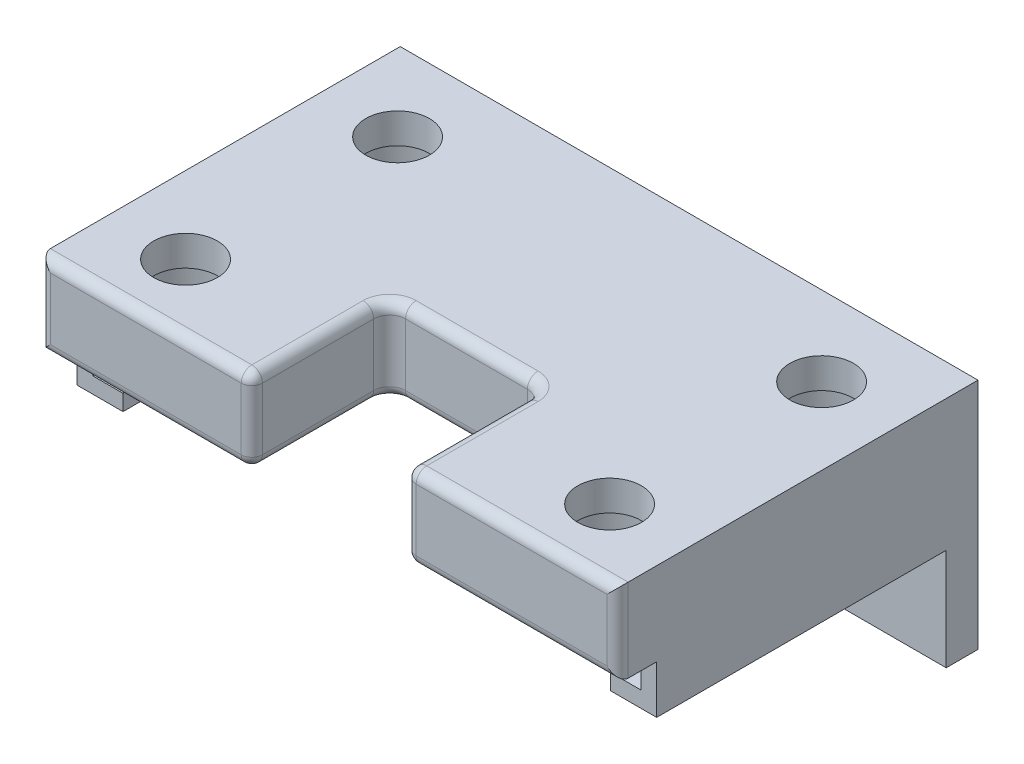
from build123d import *

# Parameters (mm, degrees)
CROQUIS1_W              = 54.5
CROQUIS1_H              = 30.5
SALIENTE_EXTRUIR1_DEPTH = 7.85
SALIENTE_EXTRUIR2_DEPTH = 30.5
CROQUIS3_W              = 54.5
CROQUIS3_H              = 7.85
SALIENTE_EXTRUIR3_DEPTH = 4.5
CROQUIS4_W              = 1.5
CROQUIS4_H              = 30.309371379
SALIENTE_EXTRUIR4_DEPTH = 4.55
CROQUIS5_W              = 30.309371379
CROQUIS5_H              = 1.5
SALIENTE_EXTRUIR5_DEPTH = 2.85
CORTAR_EXTRUIR1_DEPTH   = 60.739287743
TALADRO1_AT_2_COUNT     = 2
TALADRO1_AT_2_PITCH     = 40
TALADRO1_AT_3_COUNT     = 2
TALADRO1_AT_3_PITCH     = 20
TALADRO1_AT_4_COUNT     = 2
TALADRO1_AT_4_PITCH     = 44.72135955
REDONDEO1_R             = 1.5
CROQUIS11_R             = 1.75
SALIENTE_EXTRUIR6_DEPTH = 3
CHAFL_N2_SIZE           = 1
REDONDEO2_R             = 1


with BuildPart() as part:
    # Croquis1 → Saliente-Extruir1 (new body)
    with BuildSketch(Plane.XZ.offset(-3.05)):
        with Locations((22.9, 10.25)):
            Rectangle(CROQUIS1_W, CROQUIS1_H)
    extrude(amount=-SALIENTE_EXTRUIR1_DEPTH)

    # Croquis2 → Saliente-Extruir2 (add)
    with BuildSketch(Plane.XY.offset(25.5)):
        Polygon((-4.35, 3.05), (-4.35, -1.5), (0, -1.5), (0, 0), (-2.85, 0), (-2.85, 3.05), align=None)
    extrude(amount=-SALIENTE_EXTRUIR2_DEPTH)

    # Croquis3 → Saliente-Extruir3 (add)
    with BuildSketch(Plane.XY.offset(25.5)):
        with Locations((22.9, 6.975)):
            Rectangle(CROQUIS3_W, CROQUIS3_H)
    extrude(amount=SALIENTE_EXTRUIR3_DEPTH)

    # Croquis4 → Saliente-Extruir4 (add)
    with BuildSketch(Plane.XZ.offset(-3.05)):
        with Locations((49.4, 10.15468569)):
            Rectangle(CROQUIS4_W, CROQUIS4_H)
    extrude(amount=SALIENTE_EXTRUIR4_DEPTH)

    # Croquis5 → Saliente-Extruir5 (add)
    with BuildSketch(Plane.ZY.offset(-48.65)):
        with Locations((10.15468569, -0.75)):
            Rectangle(CROQUIS5_W, CROQUIS5_H)
    extrude(amount=SALIENTE_EXTRUIR5_DEPTH)

    # Croquis6 → Cortar-Extruir1 (cut, through all)
    with BuildSketch(Plane(origin=(0, 10.9, 0), x_dir=(-1, 0, 0), z_dir=(0, 1, 0))):
        Polygon((-30.15, 29), (-30.15, 16), (-15.65, 16), (-15.65, 29), (4.35, 29), (4.35, 30), (-50.15, 30), (-50.15, 29), align=None)
    extrude(amount=-CORTAR_EXTRUIR1_DEPTH, mode=Mode.SUBTRACT)

    # Croquis7 → Taladro1 (revolve, cut)
    with BuildSketch(Plane(origin=(2.9, 3.05, 2.5), x_dir=(0, 0, -1), z_dir=(1, 0, 0))):
        Polygon((0, 0), (0, 7.85), (3, 7.85), (3, 5), (4.5, 5), (4.5, 0), align=None)
    taladro1 = revolve(axis=Axis((2.9, 113.05, 2.5), (0, -1, 0)), mode=Mode.SUBTRACT)

    # Taladro1 at 2: Taladro1 ×2
    with Locations(*[(i * TALADRO1_AT_2_PITCH, 0, 0) for i in range(1, TALADRO1_AT_2_COUNT)]):
        add(taladro1, mode=Mode.SUBTRACT)

    # Taladro1 at 3: Taladro1 ×2
    with Locations(*[(0, 0, i * TALADRO1_AT_3_PITCH) for i in range(1, TALADRO1_AT_3_COUNT)]):
        add(taladro1, mode=Mode.SUBTRACT)

    # Taladro1 at 4: Taladro1 ×2
    with Locations(*[Vector(0.894427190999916, 0, 0.447213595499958) * (i * TALADRO1_AT_4_PITCH) for i in range(1, TALADRO1_AT_4_COUNT)]):
        add(taladro1, mode=Mode.SUBTRACT)

    # Redondeo1
    redondeo1_edges = [part.edges().sort_by_distance(p)[0] for p in [
        (15.65, 6.975, 16),
        (30.15, 6.975, 16),
    ]]
    fillet(redondeo1_edges, radius=REDONDEO1_R)

    # Croquis11 → Saliente-Extruir6 (add)
    with BuildSketch(Plane(origin=(0, 0, -5), x_dir=(-1, 0, 0), z_dir=(0, 0, -1))):
        with BuildLine():
            Line((-50.15, 10.9), (4.35, 10.9))
            Line((4.35, 10.9), (4.35, -11.1))
            Line((4.35, -11.1), (-12.812879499, -11.1))
            ThreePointArc((-12.812879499, -11.1), (-22.9, -5.6), (-32.987120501, -11.1))
            Line((-32.987120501, -11.1), (-50.15, -11.1))
            Line((-50.15, -11.1), (-50.15, 10.9))
        make_face()
        with Locations((-38.4, -2.6)):
            Circle(CROQUIS11_R, mode=Mode.SUBTRACT)
        with Locations((-7.4, -2.6)):
            Circle(CROQUIS11_R, mode=Mode.SUBTRACT)
    extrude(amount=-SALIENTE_EXTRUIR6_DEPTH)

    # Chafl_n2
    chafl_n2_edges = [part.edges().sort_by_distance(p)[0] for p in [
        (40.15, -2.6, -5),
        (9.15, -2.6, -5),
    ]]
    chamfer(chafl_n2_edges, length=CHAFL_N2_SIZE)

    # Redondeo2
    redondeo2_edges = [part.edges().sort_by_distance(p)[0] for p in [
        (15.65, 10.9, 23.25),
        (22.9, 3.05, 16),
        (22.9, 10.9, 16),
        (30.15, 3.05, 23.25),
        (16.089339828, 10.9, 16.439339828),
        (16.089339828, 3.05, 16.439339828),
        (29.710660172, 10.9, 16.439339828),
        (29.710660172, 3.05, 16.439339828),
        (40.15, 3.05, 29),
        (5.65, 3.05, 29),
        (15.65, 3.05, 23.25),
        (30.15, 6.975, 29),
        (50.15, 6.975, 29),
        (-4.35, 6.975, 29),
        (15.65, 6.975, 29),
        (5.65, 10.9, 29),
        (40.15, 10.9, 29),
        (30.15, 10.9, 23.25),
    ]]
    fillet(redondeo2_edges, radius=REDONDEO2_R)


solid = part.part
